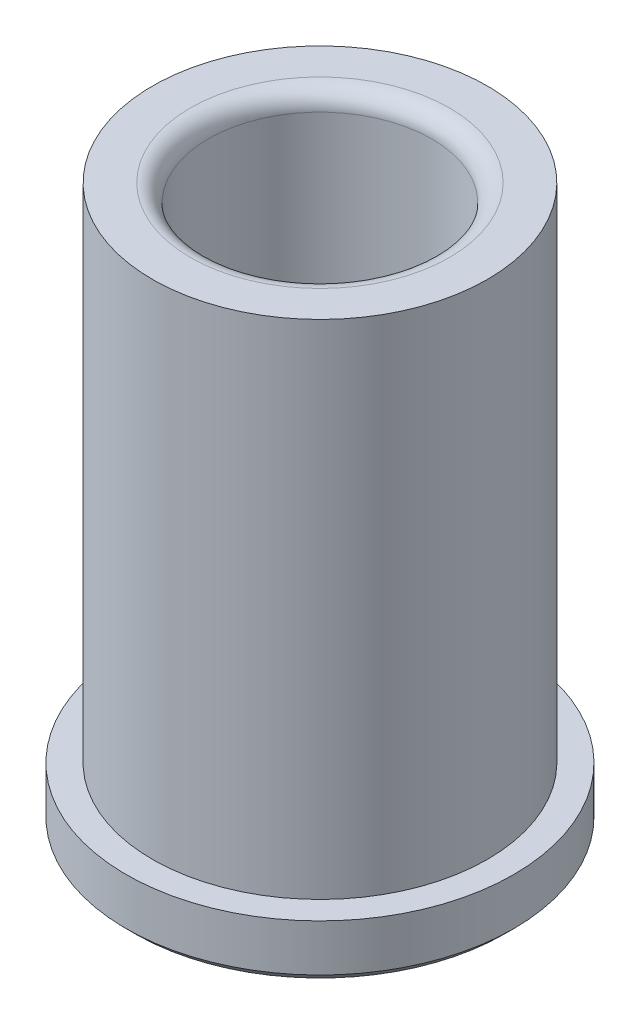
ISO-10303-21;
HEADER;
FILE_DESCRIPTION(('STEP AP214'),'2;1');
FILE_NAME('part.step','',(''),(''),'','','');
FILE_SCHEMA(('AUTOMOTIVE_DESIGN { 1 0 10303 214 1 1 1 1 }'));
ENDSEC;
DATA;
#1=APPLICATION_CONTEXT('core data for automotive mechanical design processes');
#2=APPLICATION_PROTOCOL_DEFINITION('international standard','automotive_design',2000,#1);
#3=PRODUCT_CONTEXT('',#1,'mechanical');
#4=PRODUCT('Part','Part','',(#3));
#5=PRODUCT_RELATED_PRODUCT_CATEGORY('part','',(#4));
#6=PRODUCT_DEFINITION_FORMATION('','',#4);
#7=PRODUCT_DEFINITION_CONTEXT('part definition',#1,'design');
#8=PRODUCT_DEFINITION('design','',#6,#7);
#9=PRODUCT_DEFINITION_SHAPE('','',#8);
#10=(LENGTH_UNIT() NAMED_UNIT(*) SI_UNIT(.MILLI.,.METRE.));
#11=(NAMED_UNIT(*) PLANE_ANGLE_UNIT() SI_UNIT($,.RADIAN.));
#12=(NAMED_UNIT(*) SI_UNIT($,.STERADIAN.) SOLID_ANGLE_UNIT());
#13=UNCERTAINTY_MEASURE_WITH_UNIT(LENGTH_MEASURE(1.E-05),#10,'distance_accuracy_value','');
#14=(GEOMETRIC_REPRESENTATION_CONTEXT(3) GLOBAL_UNCERTAINTY_ASSIGNED_CONTEXT((#13)) GLOBAL_UNIT_ASSIGNED_CONTEXT((#10,
#11,#12)) REPRESENTATION_CONTEXT('',''));
#15=CARTESIAN_POINT('',(0.,0.,0.));
#16=DIRECTION('',(0.,0.,1.));
#17=DIRECTION('',(1.,0.,0.));
#18=AXIS2_PLACEMENT_3D('',#15,#16,#17);
#19=CARTESIAN_POINT('',(3.49148336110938E-12,-1000.,0.));
#20=DIRECTION('',(0.,-1.,0.));
#21=DIRECTION('',(1.,0.,0.));
#22=AXIS2_PLACEMENT_3D('',#19,#20,#21);
#23=CYLINDRICAL_SURFACE('',#22,14.2938499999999);
#24=CARTESIAN_POINT('',(0.,4.7625,0.));
#25=DIRECTION('',(0.,-1.,0.));
#26=DIRECTION('',(1.,0.,0.));
#27=AXIS2_PLACEMENT_3D('',#24,#25,#26);
#28=CIRCLE('',#27,14.29385);
#29=CARTESIAN_POINT('',(14.29385,4.76250000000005,0.));
#30=VERTEX_POINT('',#29);
#31=EDGE_CURVE('E60',#30,#30,#28,.T.);
#32=ORIENTED_EDGE('',*,*,#31,.F.);
#33=EDGE_LOOP('',(#32));
#34=FACE_BOUND('',#33,.T.);
#35=CARTESIAN_POINT('',(-1.66281895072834E-13,47.625,0.));
#36=DIRECTION('',(0.,-1.,0.));
#37=DIRECTION('',(1.,0.,0.));
#38=AXIS2_PLACEMENT_3D('',#35,#36,#37);
#39=CIRCLE('',#38,14.2938499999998);
#40=CARTESIAN_POINT('',(14.2938499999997,47.6250000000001,0.));
#41=VERTEX_POINT('',#40);
#42=EDGE_CURVE('E39',#41,#41,#39,.T.);
#43=ORIENTED_EDGE('',*,*,#42,.T.);
#44=EDGE_LOOP('',(#43));
#45=FACE_BOUND('',#44,.T.);
#46=ADVANCED_FACE('F28',(#34,#45),#23,.T.);
#47=CARTESIAN_POINT('',(-14.29385,47.625,0.));
#48=DIRECTION('',(0.,-1.,0.));
#49=DIRECTION('',(1.,0.,0.));
#50=AXIS2_PLACEMENT_3D('',#47,#48,#49);
#51=PLANE('',#50);
#52=CARTESIAN_POINT('',(-1.66281895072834E-13,47.625,0.));
#53=DIRECTION('',(0.,-1.,0.));
#54=DIRECTION('',(1.,0.,0.));
#55=AXIS2_PLACEMENT_3D('',#52,#53,#54);
#56=CIRCLE('',#55,11.0553499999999);
#57=CARTESIAN_POINT('',(11.0553499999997,47.6250000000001,0.));
#58=VERTEX_POINT('',#57);
#59=EDGE_CURVE('E35',#58,#58,#56,.T.);
#60=ORIENTED_EDGE('',*,*,#59,.T.);
#61=EDGE_LOOP('',(#60));
#62=FACE_BOUND('',#61,.T.);
#63=ORIENTED_EDGE('',*,*,#42,.F.);
#64=EDGE_LOOP('',(#63));
#65=FACE_BOUND('',#64,.T.);
#66=ADVANCED_FACE('F68',(#62,#65),#51,.F.);
#67=CARTESIAN_POINT('',(3.49148336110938E-12,-1000.,0.));
#68=DIRECTION('',(0.,-1.,0.));
#69=DIRECTION('',(1.,0.,0.));
#70=AXIS2_PLACEMENT_3D('',#67,#68,#69);
#71=CYLINDRICAL_SURFACE('',#70,9.53134999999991);
#72=CARTESIAN_POINT('',(-1.60960874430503E-13,46.1009999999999,0.));
#73=DIRECTION('',(0.,-1.,0.));
#74=DIRECTION('',(1.,0.,0.));
#75=AXIS2_PLACEMENT_3D('',#72,#73,#74);
#76=CIRCLE('',#75,9.53134999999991);
#77=CARTESIAN_POINT('',(9.53134999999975,46.101,0.));
#78=VERTEX_POINT('',#77);
#79=EDGE_CURVE('E10',#78,#78,#76,.F.);
#80=ORIENTED_EDGE('',*,*,#79,.T.);
#81=EDGE_LOOP('',(#80));
#82=FACE_BOUND('',#81,.T.);
#83=CARTESIAN_POINT('',(0.,0.761999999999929,0.));
#84=DIRECTION('',(0.,-1.,0.));
#85=DIRECTION('',(1.,0.,0.));
#86=AXIS2_PLACEMENT_3D('',#83,#84,#85);
#87=CIRCLE('',#86,9.53134999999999);
#88=CARTESIAN_POINT('',(9.53134999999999,0.761999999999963,0.));
#89=VERTEX_POINT('',#88);
#90=EDGE_CURVE('E43',#89,#89,#87,.T.);
#91=ORIENTED_EDGE('',*,*,#90,.T.);
#92=EDGE_LOOP('',(#91));
#93=FACE_BOUND('',#92,.T.);
#94=ADVANCED_FACE('F72',(#82,#93),#71,.F.);
#95=CARTESIAN_POINT('',(0.,0.,0.));
#96=DIRECTION('',(0.,-1.,0.));
#97=DIRECTION('',(1.,0.,0.));
#98=AXIS2_PLACEMENT_3D('',#95,#96,#97);
#99=CONICAL_SURFACE('',#98,10.29335,0.78539816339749);
#100=ORIENTED_EDGE('',*,*,#90,.F.);
#101=EDGE_LOOP('',(#100));
#102=FACE_BOUND('',#101,.T.);
#103=CARTESIAN_POINT('',(0.,0.,0.));
#104=DIRECTION('',(0.,-1.,0.));
#105=DIRECTION('',(1.,0.,0.));
#106=AXIS2_PLACEMENT_3D('',#103,#104,#105);
#107=CIRCLE('',#106,10.29335);
#108=CARTESIAN_POINT('',(10.29335,0.,0.));
#109=VERTEX_POINT('',#108);
#110=EDGE_CURVE('E48',#109,#109,#107,.T.);
#111=ORIENTED_EDGE('',*,*,#110,.T.);
#112=EDGE_LOOP('',(#111));
#113=FACE_BOUND('',#112,.T.);
#114=ADVANCED_FACE('F77',(#102,#113),#99,.F.);
#115=CARTESIAN_POINT('',(-10.29335,0.,0.));
#116=DIRECTION('',(0.,1.,0.));
#117=DIRECTION('',(-1.,0.,0.));
#118=AXIS2_PLACEMENT_3D('',#115,#116,#117);
#119=PLANE('',#118);
#120=ORIENTED_EDGE('',*,*,#110,.F.);
#121=EDGE_LOOP('',(#120));
#122=FACE_BOUND('',#121,.T.);
#123=CARTESIAN_POINT('',(0.,0.,0.));
#124=DIRECTION('',(0.,-1.,0.));
#125=DIRECTION('',(1.,0.,0.));
#126=AXIS2_PLACEMENT_3D('',#123,#124,#125);
#127=CIRCLE('',#126,15.7734);
#128=CARTESIAN_POINT('',(15.7734,0.,0.));
#129=VERTEX_POINT('',#128);
#130=EDGE_CURVE('E51',#129,#129,#127,.T.);
#131=ORIENTED_EDGE('',*,*,#130,.T.);
#132=EDGE_LOOP('',(#131));
#133=FACE_BOUND('',#132,.T.);
#134=ADVANCED_FACE('F82',(#122,#133),#119,.F.);
#135=CARTESIAN_POINT('',(0.,0.761999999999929,0.));
#136=DIRECTION('',(0.,1.,0.));
#137=DIRECTION('',(-1.,0.,0.));
#138=AXIS2_PLACEMENT_3D('',#135,#136,#137);
#139=CONICAL_SURFACE('',#138,16.5354,0.785398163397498);
#140=ORIENTED_EDGE('',*,*,#130,.F.);
#141=EDGE_LOOP('',(#140));
#142=FACE_BOUND('',#141,.T.);
#143=CARTESIAN_POINT('',(0.,0.761999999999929,0.));
#144=DIRECTION('',(0.,-1.,0.));
#145=DIRECTION('',(1.,0.,0.));
#146=AXIS2_PLACEMENT_3D('',#143,#144,#145);
#147=CIRCLE('',#146,16.5354);
#148=CARTESIAN_POINT('',(16.5354,0.761999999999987,0.));
#149=VERTEX_POINT('',#148);
#150=EDGE_CURVE('E54',#149,#149,#147,.T.);
#151=ORIENTED_EDGE('',*,*,#150,.T.);
#152=EDGE_LOOP('',(#151));
#153=FACE_BOUND('',#152,.T.);
#154=ADVANCED_FACE('F86',(#142,#153),#139,.T.);
#155=CARTESIAN_POINT('',(3.49148336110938E-12,-1000.,0.));
#156=DIRECTION('',(0.,-1.,0.));
#157=DIRECTION('',(1.,0.,0.));
#158=AXIS2_PLACEMENT_3D('',#155,#156,#157);
#159=CYLINDRICAL_SURFACE('',#158,16.5354);
#160=ORIENTED_EDGE('',*,*,#150,.F.);
#161=EDGE_LOOP('',(#160));
#162=FACE_BOUND('',#161,.T.);
#163=CARTESIAN_POINT('',(0.,4.7625,0.));
#164=DIRECTION('',(0.,-1.,0.));
#165=DIRECTION('',(1.,0.,0.));
#166=AXIS2_PLACEMENT_3D('',#163,#164,#165);
#167=CIRCLE('',#166,16.5354);
#168=CARTESIAN_POINT('',(16.5354,4.76250000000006,0.));
#169=VERTEX_POINT('',#168);
#170=EDGE_CURVE('E57',#169,#169,#167,.T.);
#171=ORIENTED_EDGE('',*,*,#170,.T.);
#172=EDGE_LOOP('',(#171));
#173=FACE_BOUND('',#172,.T.);
#174=ADVANCED_FACE('F90',(#162,#173),#159,.T.);
#175=CARTESIAN_POINT('',(-16.5354,4.76249999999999,0.));
#176=DIRECTION('',(0.,-1.,0.));
#177=DIRECTION('',(1.,0.,0.));
#178=AXIS2_PLACEMENT_3D('',#175,#176,#177);
#179=PLANE('',#178);
#180=ORIENTED_EDGE('',*,*,#170,.F.);
#181=EDGE_LOOP('',(#180));
#182=FACE_BOUND('',#181,.T.);
#183=ORIENTED_EDGE('',*,*,#31,.T.);
#184=EDGE_LOOP('',(#183));
#185=FACE_BOUND('',#184,.T.);
#186=ADVANCED_FACE('F64',(#182,#185),#179,.F.);
#187=CARTESIAN_POINT('',(-1.60960874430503E-13,46.1009999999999,0.));
#188=DIRECTION('',(0.,-1.,0.));
#189=DIRECTION('',(1.,0.,0.));
#190=AXIS2_PLACEMENT_3D('',#187,#188,#189);
#191=TOROIDAL_SURFACE('',#190,11.0553499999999,1.524);
#192=ORIENTED_EDGE('',*,*,#79,.F.);
#193=EDGE_LOOP('',(#192));
#194=FACE_BOUND('',#193,.T.);
#195=ORIENTED_EDGE('',*,*,#59,.F.);
#196=EDGE_LOOP('',(#195));
#197=FACE_BOUND('',#196,.T.);
#198=ADVANCED_FACE('F30',(#194,#197),#191,.T.);
#199=CLOSED_SHELL('',(#46,#66,#94,#114,#134,#154,#174,#186,#198));
#200=MANIFOLD_SOLID_BREP('B2',#199);
#201=ADVANCED_BREP_SHAPE_REPRESENTATION('',(#18,#200),#14);
#202=SHAPE_DEFINITION_REPRESENTATION(#9,#201);
ENDSEC;
END-ISO-10303-21;
